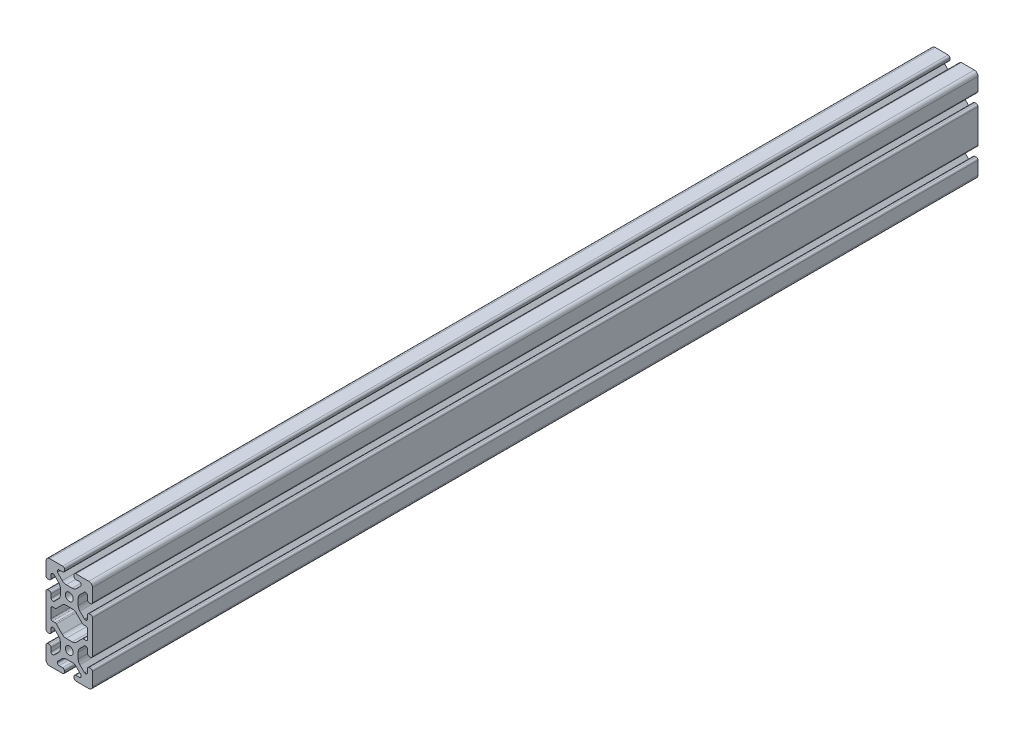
from build123d import *

# Parameters (mm, degrees)
SKETCH1_R           = 3.405
BOSS_EXTRUDE1_DEPTH = 3048
SKETCH26_W          = 40
SKETCH26_H          = 80.80011746
CUT_EXTRUDE1_DEPTH  = 2287.874723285


with BuildPart() as part:
    # Sketch1 → Boss-Extrude1 (new body)
    with BuildSketch(Plane(origin=(0, 0, -3048), x_dir=(-1, 0, 0), z_dir=(0, 0, -1))):
        with BuildLine():
            Line((16.83, 60), (5.69044933, 60))
            ThreePointArc((5.69044933, 60), (4.580291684, 59.540157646), (4.12044933, 58.43))
            Line((4.12044933, 58.43), (4.12044933, 57.25))
            ThreePointArc((4.12044933, 57.25), (4.580291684, 56.139842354), (5.69044933, 55.68))
            Line((5.69044933, 55.68), (8.7153995, 55.68))
            ThreePointArc((8.7153995, 55.68), (9.825557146, 55.220157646), (10.2853995, 54.11))
            Line((10.2853995, 54.11), (10.2853995, 53.654903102))
            ThreePointArc((10.2853995, 53.654903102), (10.227547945, 53.364063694), (10.062800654, 53.117501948))
            Line((10.062800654, 53.117501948), (6.055092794, 49.109794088))
            ThreePointArc((6.055092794, 49.109794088), (4.47691877, 48.055291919), (2.615335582, 47.685))
            Line((2.615335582, 47.685), (-2.615335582, 47.685))
            ThreePointArc((-2.615335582, 47.685), (-4.47691877, 48.055291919), (-6.055092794, 49.109794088))
            Line((-6.055092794, 49.109794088), (-10.062800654, 53.117501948))
            ThreePointArc((-10.062800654, 53.117501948), (-10.227547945, 53.364063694), (-10.2853995, 53.654903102))
            Line((-10.2853995, 53.654903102), (-10.2853995, 54.11))
            ThreePointArc((-10.2853995, 54.11), (-9.825557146, 55.220157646), (-8.7153995, 55.68))
            Line((-8.7153995, 55.68), (-5.69044933, 55.68))
            ThreePointArc((-5.69044933, 55.68), (-4.580291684, 56.139842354), (-4.12044933, 57.25))
            Line((-4.12044933, 57.25), (-4.12044933, 58.43))
            ThreePointArc((-4.12044933, 58.43), (-4.580291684, 59.540157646), (-5.69044933, 60))
            Line((-5.69044933, 60), (-16.83, 60))
            ThreePointArc((-16.83, 60), (-19.071528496, 59.071528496), (-20, 56.83))
            Line((-20, 56.83), (-20, 45.69044933))
            ThreePointArc((-20, 45.69044933), (-19.540157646, 44.580291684), (-18.43, 44.12044933))
            Line((-18.43, 44.12044933), (-17.25, 44.12044933))
            ThreePointArc((-17.25, 44.12044933), (-16.139842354, 44.580291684), (-15.68, 45.69044933))
            Line((-15.68, 45.69044933), (-15.68, 48.7153995))
            ThreePointArc((-15.68, 48.7153995), (-15.220157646, 49.825557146), (-14.11, 50.2853995))
            Line((-14.11, 50.2853995), (-13.652670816, 50.2853995))
            ThreePointArc((-13.652670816, 50.2853995), (-13.361831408, 50.227547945), (-13.115269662, 50.062800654))
            Line((-13.115269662, 50.062800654), (-9.109794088, 46.05732508))
            ThreePointArc((-9.109794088, 46.05732508), (-8.055291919, 44.479151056), (-7.685, 42.617567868))
            Line((-7.685, 42.617567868), (-7.685, 37.384664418))
            ThreePointArc((-7.685, 37.384664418), (-8.055291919, 35.52308123), (-9.109794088, 33.944907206))
            Line((-9.109794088, 33.944907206), (-13.117501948, 29.937199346))
            ThreePointArc((-13.117501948, 29.937199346), (-13.364063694, 29.772452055), (-13.654903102, 29.7146005))
            Line((-13.654903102, 29.7146005), (-14.11, 29.7146005))
            ThreePointArc((-14.11, 29.7146005), (-15.220157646, 30.174442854), (-15.68, 31.2846005))
            Line((-15.68, 31.2846005), (-15.68, 34.30955067))
            ThreePointArc((-15.68, 34.30955067), (-16.139842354, 35.419708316), (-17.25, 35.87955067))
            Line((-17.25, 35.87955067), (-18.43, 35.87955067))
            ThreePointArc((-18.43, 35.87955067), (-19.540157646, 35.419708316), (-20, 34.30955067))
            Line((-20, 34.30955067), (-20, 5.69044933))
            ThreePointArc((-20, 5.69044933), (-19.540157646, 4.580291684), (-18.43, 4.12044933))
            Line((-18.43, 4.12044933), (-17.25, 4.12044933))
            ThreePointArc((-17.25, 4.12044933), (-16.139842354, 4.580291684), (-15.68, 5.69044933))
            Line((-15.68, 5.69044933), (-15.68, 8.7153995))
            ThreePointArc((-15.68, 8.7153995), (-15.220157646, 9.825557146), (-14.11, 10.2853995))
            Line((-14.11, 10.2853995), (-13.654903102, 10.2853995))
            ThreePointArc((-13.654903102, 10.2853995), (-13.364063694, 10.227547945), (-13.117501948, 10.062800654))
            Line((-13.117501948, 10.062800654), (-9.109794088, 6.055092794))
            ThreePointArc((-9.109794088, 6.055092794), (-8.055291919, 4.47691877), (-7.685, 2.615335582))
            Line((-7.685, 2.615335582), (-7.685, -2.615335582))
            ThreePointArc((-7.685, -2.615335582), (-8.055291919, -4.47691877), (-9.109794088, -6.055092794))
            Line((-9.109794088, -6.055092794), (-13.117501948, -10.062800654))
            ThreePointArc((-13.117501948, -10.062800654), (-13.364063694, -10.227547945), (-13.654903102, -10.2853995))
            Line((-13.654903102, -10.2853995), (-14.11, -10.2853995))
            ThreePointArc((-14.11, -10.2853995), (-15.220157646, -9.825557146), (-15.68, -8.7153995))
            Line((-15.68, -8.7153995), (-15.68, -5.69044933))
            ThreePointArc((-15.68, -5.69044933), (-16.139842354, -4.580291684), (-17.25, -4.12044933))
            Line((-17.25, -4.12044933), (-18.43, -4.12044933))
            ThreePointArc((-18.43, -4.12044933), (-19.540157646, -4.580291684), (-20, -5.69044933))
            Line((-20, -5.69044933), (-20, -16.83))
            ThreePointArc((-20, -16.83), (-19.071528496, -19.071528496), (-16.83, -20))
            Line((-16.83, -20), (-5.69044933, -20))
            ThreePointArc((-5.69044933, -20), (-4.580291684, -19.540157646), (-4.12044933, -18.43))
            Line((-4.12044933, -18.43), (-4.12044933, -17.25))
            ThreePointArc((-4.12044933, -17.25), (-4.580291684, -16.139842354), (-5.69044933, -15.68))
            Line((-5.69044933, -15.68), (-8.7153995, -15.68))
            ThreePointArc((-8.7153995, -15.68), (-9.825557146, -15.220157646), (-10.2853995, -14.11))
            Line((-10.2853995, -14.11), (-10.2853995, -13.654903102))
            ThreePointArc((-10.2853995, -13.654903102), (-10.227547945, -13.364063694), (-10.062800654, -13.117501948))
            Line((-10.062800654, -13.117501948), (-6.055092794, -9.109794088))
            ThreePointArc((-6.055092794, -9.109794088), (-4.47691877, -8.055291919), (-2.615335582, -7.685))
            Line((-2.615335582, -7.685), (2.615335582, -7.685))
            ThreePointArc((2.615335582, -7.685), (4.47691877, -8.055291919), (6.055092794, -9.109794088))
            Line((6.055092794, -9.109794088), (10.062800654, -13.117501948))
            ThreePointArc((10.062800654, -13.117501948), (10.227547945, -13.364063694), (10.2853995, -13.654903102))
            Line((10.2853995, -13.654903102), (10.2853995, -14.11))
            ThreePointArc((10.2853995, -14.11), (9.825557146, -15.220157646), (8.7153995, -15.68))
            Line((8.7153995, -15.68), (5.69044933, -15.68))
            ThreePointArc((5.69044933, -15.68), (4.580291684, -16.139842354), (4.12044933, -17.25))
            Line((4.12044933, -17.25), (4.12044933, -18.43))
            ThreePointArc((4.12044933, -18.43), (4.580291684, -19.540157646), (5.69044933, -20))
            Line((5.69044933, -20), (16.83, -20))
            ThreePointArc((16.83, -20), (19.071528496, -19.071528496), (20, -16.83))
            Line((20, -16.83), (20, -5.69044933))
            ThreePointArc((20, -5.69044933), (19.540157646, -4.580291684), (18.43, -4.12044933))
            Line((18.43, -4.12044933), (17.25, -4.12044933))
            ThreePointArc((17.25, -4.12044933), (16.139842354, -4.580291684), (15.68, -5.69044933))
            Line((15.68, -5.69044933), (15.68, -8.7153995))
            ThreePointArc((15.68, -8.7153995), (15.220157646, -9.825557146), (14.11, -10.2853995))
            Line((14.11, -10.2853995), (13.654903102, -10.2853995))
            ThreePointArc((13.654903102, -10.2853995), (13.364063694, -10.227547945), (13.117501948, -10.062800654))
            Line((13.117501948, -10.062800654), (9.109794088, -6.055092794))
            ThreePointArc((9.109794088, -6.055092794), (8.055291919, -4.47691877), (7.685, -2.615335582))
            Line((7.685, -2.615335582), (7.685, 2.615335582))
            ThreePointArc((7.685, 2.615335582), (8.055291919, 4.47691877), (9.109794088, 6.055092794))
            Line((9.109794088, 6.055092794), (13.117501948, 10.062800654))
            ThreePointArc((13.117501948, 10.062800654), (13.364063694, 10.227547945), (13.654903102, 10.2853995))
            Line((13.654903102, 10.2853995), (14.11, 10.2853995))
            ThreePointArc((14.11, 10.2853995), (15.220157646, 9.825557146), (15.68, 8.7153995))
            Line((15.68, 8.7153995), (15.68, 5.69044933))
            ThreePointArc((15.68, 5.69044933), (16.139842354, 4.580291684), (17.25, 4.12044933))
            Line((17.25, 4.12044933), (18.43, 4.12044933))
            ThreePointArc((18.43, 4.12044933), (19.540157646, 4.580291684), (20, 5.69044933))
            Line((20, 5.69044933), (20, 34.30955067))
            ThreePointArc((20, 34.30955067), (19.540157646, 35.419708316), (18.43, 35.87955067))
            Line((18.43, 35.87955067), (17.25, 35.87955067))
            ThreePointArc((17.25, 35.87955067), (16.139842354, 35.419708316), (15.68, 34.30955067))
            Line((15.68, 34.30955067), (15.68, 31.2846005))
            ThreePointArc((15.68, 31.2846005), (15.220157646, 30.174442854), (14.11, 29.7146005))
            Line((14.11, 29.7146005), (13.654903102, 29.7146005))
            ThreePointArc((13.654903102, 29.7146005), (13.364063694, 29.772452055), (13.117501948, 29.937199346))
            Line((13.117501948, 29.937199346), (9.109794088, 33.944907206))
            ThreePointArc((9.109794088, 33.944907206), (8.055291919, 35.52308123), (7.685, 37.384664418))
            Line((7.685, 37.384664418), (7.685, 42.615335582))
            ThreePointArc((7.685, 42.615335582), (8.055291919, 44.47691877), (9.109794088, 46.055092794))
            Line((9.109794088, 46.055092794), (13.117501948, 50.062800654))
            ThreePointArc((13.117501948, 50.062800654), (13.364063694, 50.227547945), (13.654903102, 50.2853995))
            Line((13.654903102, 50.2853995), (14.11, 50.2853995))
            ThreePointArc((14.11, 50.2853995), (15.220157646, 49.825557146), (15.68, 48.7153995))
            Line((15.68, 48.7153995), (15.68, 45.69044933))
            ThreePointArc((15.68, 45.69044933), (16.139842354, 44.580291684), (17.25, 44.12044933))
            Line((17.25, 44.12044933), (18.43, 44.12044933))
            ThreePointArc((18.43, 44.12044933), (19.540157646, 44.580291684), (20, 45.69044933))
            Line((20, 45.69044933), (20, 56.83))
            ThreePointArc((20, 56.83), (19.071528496, 59.071528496), (16.83, 60))
        make_face()
        with Locations(Location((0, 0, 0), (0, 0, 180))):
            Circle(SKETCH1_R, mode=Mode.SUBTRACT)
        with Locations(Location((0, 40, 0), (0, 0, 180))):
            Circle(SKETCH1_R, mode=Mode.SUBTRACT)
        with BuildLine():
            Line((14.41, 14.65864833), (12.129998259, 14.65864833))
            ThreePointArc((12.129998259, 14.65864833), (11.608780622, 14.546764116), (11.179399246, 14.230824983))
            Line((11.179399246, 14.230824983), (6.055092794, 9.109794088))
            ThreePointArc((6.055092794, 9.109794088), (4.47691877, 8.055291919), (2.615335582, 7.685))
            Line((2.615335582, 7.685), (-2.615335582, 7.685))
            ThreePointArc((-2.615335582, 7.685), (-4.47691877, 8.055291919), (-6.055092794, 9.109794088))
            Line((-6.055092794, 9.109794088), (-11.231972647, 14.286673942))
            ThreePointArc((-11.231972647, 14.286673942), (-11.6439903, 14.561975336), (-12.129998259, 14.65864833))
            Line((-12.129998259, 14.65864833), (-14.41, 14.65864833))
            ThreePointArc((-14.41, 14.65864833), (-15.308025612, 15.030622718), (-15.68, 15.92864833))
            Line((-15.68, 15.92864833), (-15.68, 24.07135167))
            ThreePointArc((-15.68, 24.07135167), (-15.308025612, 24.969377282), (-14.41, 25.34135167))
            Line((-14.41, 25.34135167), (-12.129998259, 25.34135167))
            ThreePointArc((-12.129998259, 25.34135167), (-11.6439903, 25.438024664), (-11.231972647, 25.713326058))
            Line((-11.231972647, 25.713326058), (-6.055092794, 30.890205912))
            ThreePointArc((-6.055092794, 30.890205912), (-4.47691877, 31.944708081), (-2.615335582, 32.315))
            Line((-2.615335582, 32.315), (2.617567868, 32.315))
            ThreePointArc((2.617567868, 32.315), (4.479151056, 31.944708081), (6.05732508, 30.890205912))
            Line((6.05732508, 30.890205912), (11.184160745, 25.763370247))
            ThreePointArc((11.184160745, 25.763370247), (11.612140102, 25.451641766), (12.129998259, 25.34135167))
            Line((12.129998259, 25.34135167), (14.41, 25.34135167))
            ThreePointArc((14.41, 25.34135167), (15.308025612, 24.969377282), (15.68, 24.07135167))
            Line((15.68, 24.07135167), (15.68, 15.92864833))
            ThreePointArc((15.68, 15.92864833), (15.308025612, 15.030622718), (14.41, 14.65864833))
        make_face(mode=Mode.SUBTRACT)
    extrude(amount=-BOSS_EXTRUDE1_DEPTH)

    # Sketch26 → Cut-Extrude1 (cut, through all)
    with BuildSketch(Plane.XY.offset(-762)):
        with Locations((0, 19.59994127)):
            Rectangle(SKETCH26_W, SKETCH26_H)
    extrude(amount=-CUT_EXTRUDE1_DEPTH, mode=Mode.SUBTRACT)


solid = part.part
